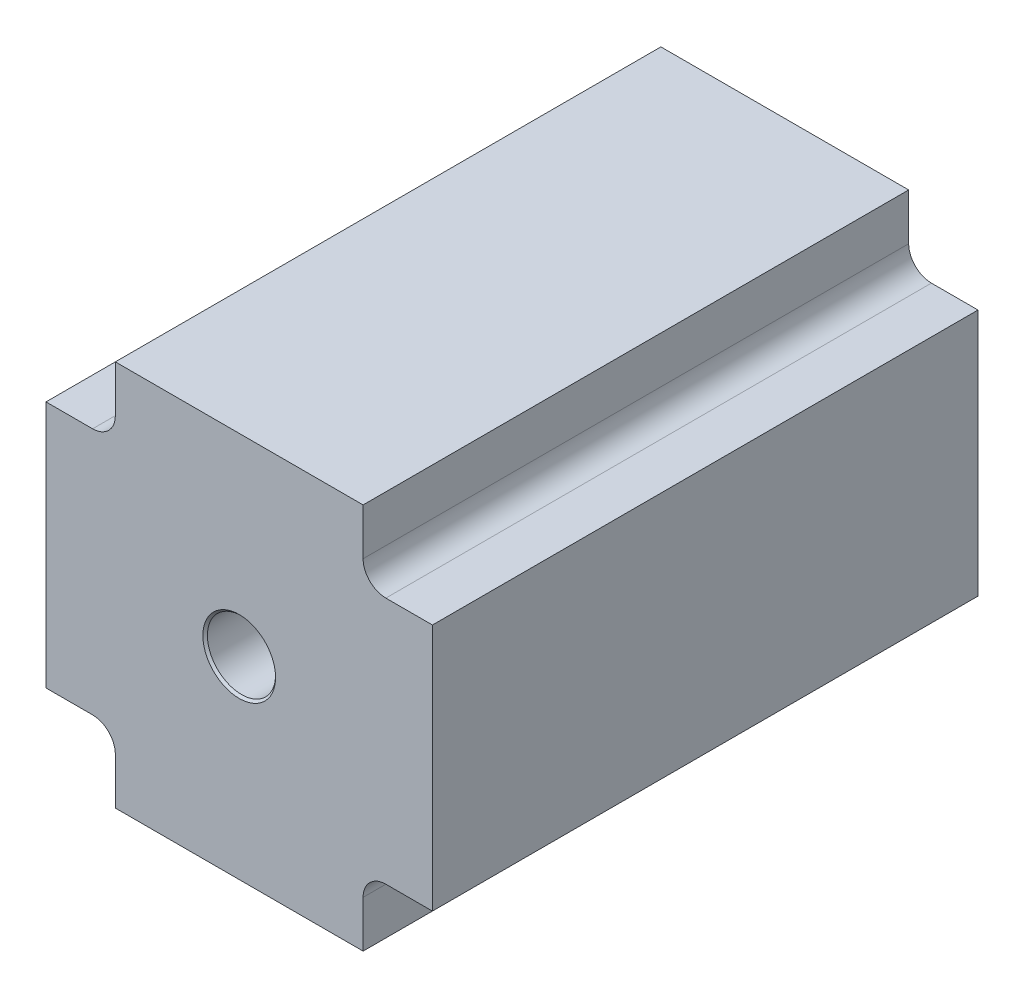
from build123d import *

# Parameters (mm, degrees)
EXTRUDE_1_DEPTH     = 120
SKETCH_3_R          = 7.5
CUT_EXTRUDE_2_DEPTH = 135.210655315
CHAMFER_3_SIZE      = 0.5
FILLET_1_R          = 5


with BuildPart() as part:
    # Sketch 1 → Extrude 1 (new body)
    with BuildSketch(Plane.XY):
        Polygon((27.25, 42.5), (-27.25, 42.5), (-27.25, 27.25), (-42.5, 27.25), (-42.5, -27.25), (-27.25, -27.25), (-27.25, -42.5), (27.25, -42.5), (27.25, -27.25), (42.5, -27.25), (42.5, 27.25), (27.25, 27.25), align=None)
    extrude(amount=EXTRUDE_1_DEPTH)

    # Sketch 3 → Cut-Extrude 2 (cut, through all)
    with BuildSketch(Plane.XY.offset(120)):
        Circle(SKETCH_3_R)
    extrude(amount=-CUT_EXTRUDE_2_DEPTH, mode=Mode.SUBTRACT)

    # Chamfer 3
    chamfer_3_edges = [part.edges().sort_by_distance(p)[0] for p in [
        (-7.5, 0, 0),
        (-7.5, 0, 120),
    ]]
    chamfer(chamfer_3_edges, length=CHAMFER_3_SIZE)

    # Fillet 1
    fillet_1_edges = [part.edges().sort_by_distance(p)[0] for p in [
        (-27.25, -27.25, 60),
        (-27.25, 27.25, 60),
        (27.25, 27.25, 60),
        (27.25, -27.25, 60),
    ]]
    fillet(fillet_1_edges, radius=FILLET_1_R)


solid = part.part
